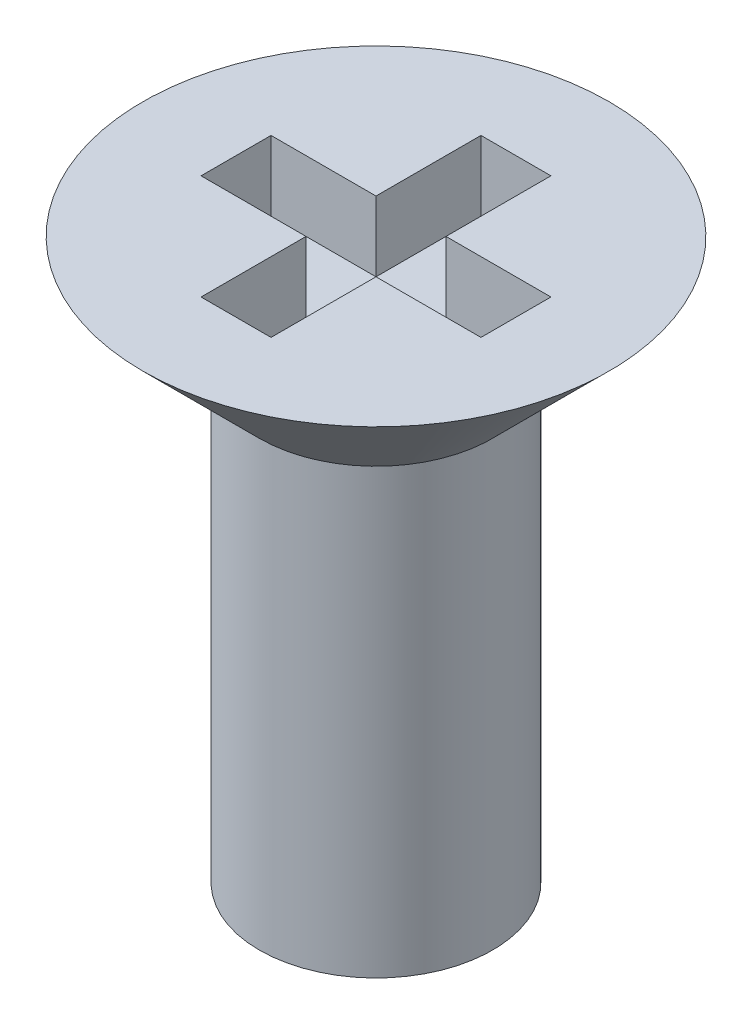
from build123d import *

# Parameters (mm, degrees)
SKETCH2_W              = 1.5
SKETCH2_H              = 3
PHILLIPS_DEPTH         = 1.5
PHILLIPS_PATTERN_COUNT = 4


with BuildPart() as part:
    # Sketch1 → FLATHEAD (revolve)
    with BuildSketch(Plane.XY, mode=Mode.PRIVATE) as flathead_sk:
        Polygon((0, 0), (2.5, 0), (2.5, 9.5), (5, 12), (0, 12), align=None)
    revolve(flathead_sk.sketch.rotate(Axis((0, 90.869303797, 0), (0, -1, 0)), 90), axis=Axis((0, 90.869303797, 0), (0, -1, 0)))

    # Sketch2 → PHILLIPS (cut)
    with BuildSketch(Plane(origin=(0, 12, 0), x_dir=(-1, 0, 0), z_dir=(0, 1, 0))):
        with Locations((0, 1.5)):
            Rectangle(SKETCH2_W, SKETCH2_H)
    phillips = extrude(amount=-PHILLIPS_DEPTH, mode=Mode.SUBTRACT)

    # PHILLIPS PATTERN: PHILLIPS ×4 about axis
    phillips_pattern_axis = Axis((0, 0, 0), (0, 1, 0))
    for i in range(1, PHILLIPS_PATTERN_COUNT):
        add(phillips.rotate(phillips_pattern_axis, i * 360 / PHILLIPS_PATTERN_COUNT), mode=Mode.SUBTRACT)


solid = part.part
